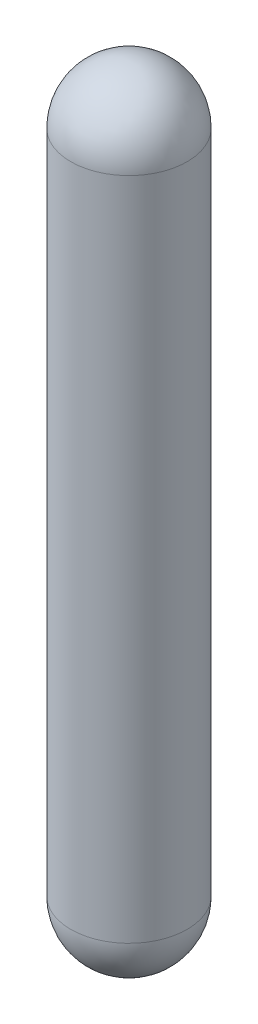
from build123d import *

# Parameters (mm, degrees)
SKETCH1_R           = 2.2225
BOSS_EXTRUDE1_DEPTH = 25.4
REVOLVE1_ANGLE      = 180
REVOLVE2_ANGLE      = 180


with BuildPart() as part:
    # Sketch1 → Boss-Extrude1 (new body)
    with BuildSketch(Plane(origin=(0, 0, 0), x_dir=(1, 0, 0), z_dir=(0, 1, 0))):
        with Locations(Location((0, 0, 0), (0, 0, 270))):
            Circle(SKETCH1_R)
    extrude(amount=BOSS_EXTRUDE1_DEPTH)

    # Sketch2 → Revolve1 (revolve)
    with BuildSketch(Plane(origin=(0, 25.4, 0), x_dir=(1, 0, 0), z_dir=(0, 1, 0))):
        with BuildLine():
            Line((-2.2225, 0), (2.2225, 0))
            ThreePointArc((2.2225, 0), (0, 2.2225), (-2.2225, 0))
        make_face()
    revolve(axis=Axis((-2.2225, 25.4, 0), (1, 0, 0)), revolution_arc=REVOLVE1_ANGLE)

    # Sketch3 → Revolve2 (revolve)
    with BuildSketch(Plane(origin=(0, 0, 0), x_dir=(-1, 0, 0), z_dir=(0, -1, 0))):
        with BuildLine():
            Line((-2.2225, 0), (2.2225, 0))
            ThreePointArc((2.2225, 0), (0, 2.2225), (-2.2225, 0))
        make_face()
    revolve(axis=Axis((2.2225, 0, 0), (-1, 0, 0)), revolution_arc=REVOLVE2_ANGLE)


solid = part.part
